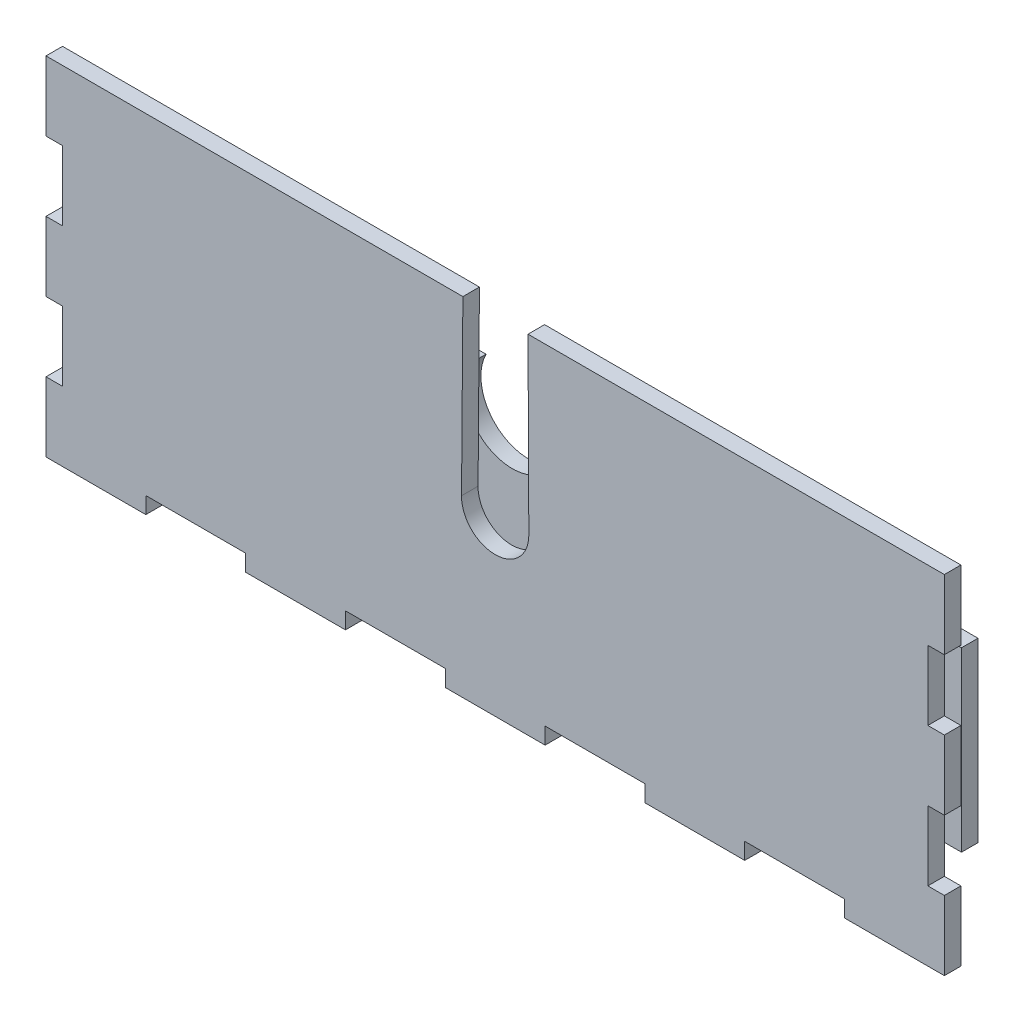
from build123d import *

# Parameters (mm, degrees)
BOSS_EXTRUDE1_DEPTH = 7.62
BOSS_EXTRUDE5_DEPTH = 7.62


with BuildPart() as part:
    # Sketch2 → Boss-Extrude1 (new body)
    with BuildSketch(Plane.XY):
        with BuildLine():
            Line((187.423058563, 0), (0, 0))
            Line((0, 0), (0, -81.548002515))
            Line((0, -81.548002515), (414.02, -81.548002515))
            Line((414.02, -81.548002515), (414.02, 0))
            Line((414.02, 0), (226.793058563, 0))
            ThreePointArc((226.793058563, 0), (207.108058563, -32.000114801), (187.423058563, 0))
        make_face()
    extrude(amount=BOSS_EXTRUDE1_DEPTH)


with BuildPart() as body_2:
    # Sketch5 → Boss-Extrude5 (new body)
    with BuildSketch(Plane.XY.offset(7.62)):
        with BuildLine():
            Line((0, 32.896397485), (192.01, 32.896397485))
            Line((192.01, 32.896397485), (191.384904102, -46.860654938))
            ThreePointArc((191.384904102, -46.860654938), (206.833789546, -62.603524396), (222.382326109, -46.959068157))
            Line((222.382326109, -46.959068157), (222.01, 32.896397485))
            Line((222.01, 32.896397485), (413.761309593, 32.896397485))
            Line((413.761309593, 32.896397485), (413.761309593, 0.896397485))
            Line((413.761309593, 0.896397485), (406.146, 0.896397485))
            Line((406.146, 0.896397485), (406.146, -31.103602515))
            Line((406.146, -31.103602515), (413.766, -31.103602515))
            Line((413.766, -31.103602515), (413.766, -63.103602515))
            Line((413.766, -63.103602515), (406.146, -63.103602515))
            Line((406.146, -63.103602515), (406.146, -95.103602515))
            Line((406.146, -95.103602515), (413.766, -95.103602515))
            Line((413.766, -95.103602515), (413.766, -127.103602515))
            Line((413.766, -127.103602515), (367.792, -127.103602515))
            Line((367.792, -127.103602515), (367.792, -119.483602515))
            Line((367.792, -119.483602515), (321.818, -119.483602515))
            Line((321.818, -119.483602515), (321.818, -127.103602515))
            Line((321.818, -127.103602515), (275.844, -127.103602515))
            Line((275.844, -127.103602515), (275.844, -119.483602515))
            Line((275.844, -119.483602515), (229.87, -119.483602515))
            Line((229.87, -119.483602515), (229.87, -127.103602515))
            Line((229.87, -127.103602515), (183.896, -127.103602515))
            Line((183.896, -127.103602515), (183.896, -119.483602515))
            Line((183.896, -119.483602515), (137.922, -119.483602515))
            Line((137.922, -119.483602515), (137.922, -127.103602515))
            Line((137.922, -127.103602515), (91.948, -127.103602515))
            Line((91.948, -127.103602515), (91.948, -119.483602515))
            Line((91.948, -119.483602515), (45.974, -119.483602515))
            Line((45.974, -119.483602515), (45.974, -127.103602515))
            Line((45.974, -127.103602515), (0, -127.103602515))
            Line((0, -127.103602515), (0, -95.103602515))
            Line((0, -95.103602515), (7.62, -95.103602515))
            Line((7.62, -95.103602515), (7.62, -63.103602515))
            Line((7.62, -63.103602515), (0, -63.103602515))
            Line((0, -63.103602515), (0, -31.103602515))
            Line((0, -31.103602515), (7.62, -31.103602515))
            Line((7.62, -31.103602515), (7.62, 0.896397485))
            Line((7.62, 0.896397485), (0, 0.896397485))
            Line((0, 0.896397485), (0, 32.896397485))
        make_face()
    extrude(amount=BOSS_EXTRUDE5_DEPTH)


solid = Compound([part.part, body_2.part])
